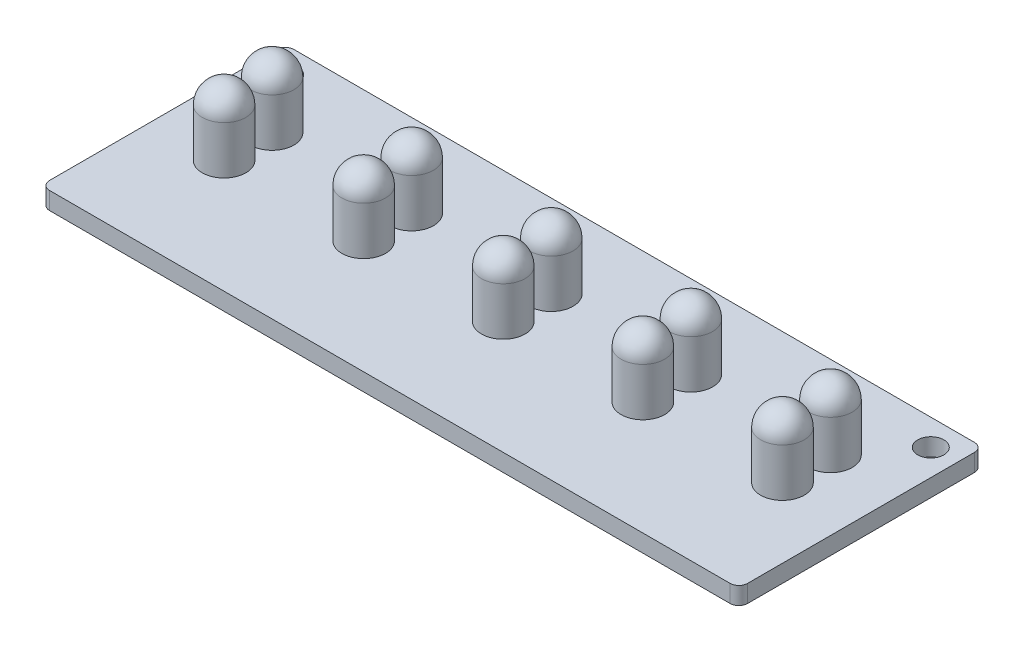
ISO-10303-21;
HEADER;
FILE_DESCRIPTION(('STEP AP214'),'2;1');
FILE_NAME('part.step','',(''),(''),'','','');
FILE_SCHEMA(('AUTOMOTIVE_DESIGN { 1 0 10303 214 1 1 1 1 }'));
ENDSEC;
DATA;
#1=APPLICATION_CONTEXT('core data for automotive mechanical design processes');
#2=APPLICATION_PROTOCOL_DEFINITION('international standard','automotive_design',2000,#1);
#3=PRODUCT_CONTEXT('',#1,'mechanical');
#4=PRODUCT('Part','Part','',(#3));
#5=PRODUCT_RELATED_PRODUCT_CATEGORY('part','',(#4));
#6=PRODUCT_DEFINITION_FORMATION('','',#4);
#7=PRODUCT_DEFINITION_CONTEXT('part definition',#1,'design');
#8=PRODUCT_DEFINITION('design','',#6,#7);
#9=PRODUCT_DEFINITION_SHAPE('','',#8);
#10=(LENGTH_UNIT() NAMED_UNIT(*) SI_UNIT(.MILLI.,.METRE.));
#11=(NAMED_UNIT(*) PLANE_ANGLE_UNIT() SI_UNIT($,.RADIAN.));
#12=(NAMED_UNIT(*) SI_UNIT($,.STERADIAN.) SOLID_ANGLE_UNIT());
#13=UNCERTAINTY_MEASURE_WITH_UNIT(LENGTH_MEASURE(1.E-05),#10,'distance_accuracy_value','');
#14=(GEOMETRIC_REPRESENTATION_CONTEXT(3) GLOBAL_UNCERTAINTY_ASSIGNED_CONTEXT((#13)) GLOBAL_UNIT_ASSIGNED_CONTEXT((#10,
#11,#12)) REPRESENTATION_CONTEXT('',''));
#15=CARTESIAN_POINT('',(0.,0.,0.));
#16=DIRECTION('',(0.,0.,1.));
#17=DIRECTION('',(1.,0.,0.));
#18=AXIS2_PLACEMENT_3D('',#15,#16,#17);
#19=CARTESIAN_POINT('',(40.,2.,14.));
#20=DIRECTION('',(-1.,0.,0.));
#21=DIRECTION('',(0.,0.,1.));
#22=AXIS2_PLACEMENT_3D('',#19,#20,#21);
#23=PLANE('',#22);
#24=DIRECTION('',(0.,0.,-1.));
#25=VECTOR('',#24,1.);
#26=CARTESIAN_POINT('',(40.,0.,14.));
#27=LINE('',#26,#25);
#28=CARTESIAN_POINT('',(40.,0.,13.));
#29=VERTEX_POINT('',#28);
#30=CARTESIAN_POINT('',(40.,0.,-13.));
#31=VERTEX_POINT('',#30);
#32=EDGE_CURVE('E198',#29,#31,#27,.T.);
#33=ORIENTED_EDGE('',*,*,#32,.T.);
#34=DIRECTION('',(0.,-1.,0.));
#35=VECTOR('',#34,1.);
#36=CARTESIAN_POINT('',(40.,2.,-13.));
#37=LINE('',#36,#35);
#38=CARTESIAN_POINT('',(40.,2.,-13.));
#39=VERTEX_POINT('',#38);
#40=EDGE_CURVE('E261',#31,#39,#37,.F.);
#41=ORIENTED_EDGE('',*,*,#40,.T.);
#42=DIRECTION('',(0.,0.,-1.));
#43=VECTOR('',#42,1.);
#44=CARTESIAN_POINT('',(40.,2.,14.));
#45=LINE('',#44,#43);
#46=CARTESIAN_POINT('',(40.,2.,13.));
#47=VERTEX_POINT('',#46);
#48=EDGE_CURVE('E210',#47,#39,#45,.T.);
#49=ORIENTED_EDGE('',*,*,#48,.F.);
#50=DIRECTION('',(0.,-1.,0.));
#51=VECTOR('',#50,1.);
#52=CARTESIAN_POINT('',(40.,2.,13.));
#53=LINE('',#52,#51);
#54=EDGE_CURVE('E257',#47,#29,#53,.T.);
#55=ORIENTED_EDGE('',*,*,#54,.T.);
#56=EDGE_LOOP('',(#33,#41,#49,#55));
#57=FACE_BOUND('',#56,.T.);
#58=ADVANCED_FACE('F45',(#57),#23,.F.);
#59=CARTESIAN_POINT('',(-40.,2.,-14.));
#60=DIRECTION('',(0.,0.,1.));
#61=DIRECTION('',(1.,0.,0.));
#62=AXIS2_PLACEMENT_3D('',#59,#60,#61);
#63=PLANE('',#62);
#64=DIRECTION('',(-1.,0.,0.));
#65=VECTOR('',#64,1.);
#66=CARTESIAN_POINT('',(-40.,2.,-14.));
#67=LINE('',#66,#65);
#68=CARTESIAN_POINT('',(39.,2.,-14.));
#69=VERTEX_POINT('',#68);
#70=CARTESIAN_POINT('',(-39.,2.,-14.));
#71=VERTEX_POINT('',#70);
#72=EDGE_CURVE('E214',#69,#71,#67,.T.);
#73=ORIENTED_EDGE('',*,*,#72,.F.);
#74=DIRECTION('',(0.,-1.,0.));
#75=VECTOR('',#74,1.);
#76=CARTESIAN_POINT('',(39.,2.,-14.));
#77=LINE('',#76,#75);
#78=CARTESIAN_POINT('',(39.,0.,-14.));
#79=VERTEX_POINT('',#78);
#80=EDGE_CURVE('E241',#69,#79,#77,.T.);
#81=ORIENTED_EDGE('',*,*,#80,.T.);
#82=DIRECTION('',(-1.,0.,0.));
#83=VECTOR('',#82,1.);
#84=CARTESIAN_POINT('',(-40.,0.,-14.));
#85=LINE('',#84,#83);
#86=CARTESIAN_POINT('',(-39.,0.,-14.));
#87=VERTEX_POINT('',#86);
#88=EDGE_CURVE('E229',#79,#87,#85,.T.);
#89=ORIENTED_EDGE('',*,*,#88,.T.);
#90=DIRECTION('',(0.,-1.,0.));
#91=VECTOR('',#90,1.);
#92=CARTESIAN_POINT('',(-39.,2.,-14.));
#93=LINE('',#92,#91);
#94=EDGE_CURVE('E225',#87,#71,#93,.F.);
#95=ORIENTED_EDGE('',*,*,#94,.T.);
#96=EDGE_LOOP('',(#73,#81,#89,#95));
#97=FACE_BOUND('',#96,.T.);
#98=ADVANCED_FACE('F312',(#97),#63,.F.);
#99=CARTESIAN_POINT('',(-40.,2.,14.));
#100=DIRECTION('',(1.,0.,0.));
#101=DIRECTION('',(0.,0.,-1.));
#102=AXIS2_PLACEMENT_3D('',#99,#100,#101);
#103=PLANE('',#102);
#104=DIRECTION('',(0.,0.,1.));
#105=VECTOR('',#104,1.);
#106=CARTESIAN_POINT('',(-40.,2.,14.));
#107=LINE('',#106,#105);
#108=CARTESIAN_POINT('',(-40.,2.,-13.));
#109=VERTEX_POINT('',#108);
#110=CARTESIAN_POINT('',(-40.,2.,13.));
#111=VERTEX_POINT('',#110);
#112=EDGE_CURVE('E219',#109,#111,#107,.T.);
#113=ORIENTED_EDGE('',*,*,#112,.F.);
#114=DIRECTION('',(0.,-1.,0.));
#115=VECTOR('',#114,1.);
#116=CARTESIAN_POINT('',(-40.,2.,-13.));
#117=LINE('',#116,#115);
#118=CARTESIAN_POINT('',(-40.,0.,-13.));
#119=VERTEX_POINT('',#118);
#120=EDGE_CURVE('E278',#109,#119,#117,.T.);
#121=ORIENTED_EDGE('',*,*,#120,.T.);
#122=DIRECTION('',(0.,0.,1.));
#123=VECTOR('',#122,1.);
#124=CARTESIAN_POINT('',(-40.,0.,14.));
#125=LINE('',#124,#123);
#126=CARTESIAN_POINT('',(-40.,0.,13.));
#127=VERTEX_POINT('',#126);
#128=EDGE_CURVE('E233',#119,#127,#125,.T.);
#129=ORIENTED_EDGE('',*,*,#128,.T.);
#130=DIRECTION('',(0.,-1.,0.));
#131=VECTOR('',#130,1.);
#132=CARTESIAN_POINT('',(-40.,2.,13.));
#133=LINE('',#132,#131);
#134=EDGE_CURVE('E275',#127,#111,#133,.F.);
#135=ORIENTED_EDGE('',*,*,#134,.T.);
#136=EDGE_LOOP('',(#113,#121,#129,#135));
#137=FACE_BOUND('',#136,.T.);
#138=ADVANCED_FACE('F286',(#137),#103,.F.);
#139=CARTESIAN_POINT('',(-40.,2.,14.));
#140=DIRECTION('',(0.,0.,-1.));
#141=DIRECTION('',(-1.,0.,0.));
#142=AXIS2_PLACEMENT_3D('',#139,#140,#141);
#143=PLANE('',#142);
#144=DIRECTION('',(1.,0.,0.));
#145=VECTOR('',#144,1.);
#146=CARTESIAN_POINT('',(-40.,2.,14.));
#147=LINE('',#146,#145);
#148=CARTESIAN_POINT('',(-39.,2.,14.));
#149=VERTEX_POINT('',#148);
#150=CARTESIAN_POINT('',(39.,2.,14.));
#151=VERTEX_POINT('',#150);
#152=EDGE_CURVE('E222',#149,#151,#147,.T.);
#153=ORIENTED_EDGE('',*,*,#152,.F.);
#154=DIRECTION('',(0.,-1.,0.));
#155=VECTOR('',#154,1.);
#156=CARTESIAN_POINT('',(-39.,2.,14.));
#157=LINE('',#156,#155);
#158=CARTESIAN_POINT('',(-39.,0.,14.));
#159=VERTEX_POINT('',#158);
#160=EDGE_CURVE('E11',#149,#159,#157,.T.);
#161=ORIENTED_EDGE('',*,*,#160,.T.);
#162=DIRECTION('',(1.,0.,0.));
#163=VECTOR('',#162,1.);
#164=CARTESIAN_POINT('',(-40.,0.,14.));
#165=LINE('',#164,#163);
#166=CARTESIAN_POINT('',(39.,0.,14.));
#167=VERTEX_POINT('',#166);
#168=EDGE_CURVE('E215',#159,#167,#165,.T.);
#169=ORIENTED_EDGE('',*,*,#168,.T.);
#170=DIRECTION('',(0.,-1.,0.));
#171=VECTOR('',#170,1.);
#172=CARTESIAN_POINT('',(39.,2.,14.));
#173=LINE('',#172,#171);
#174=EDGE_CURVE('E54',#167,#151,#173,.F.);
#175=ORIENTED_EDGE('',*,*,#174,.T.);
#176=EDGE_LOOP('',(#153,#161,#169,#175));
#177=FACE_BOUND('',#176,.T.);
#178=ADVANCED_FACE('F297',(#177),#143,.F.);
#179=CARTESIAN_POINT('',(0.,2.,0.));
#180=DIRECTION('',(0.,-1.,0.));
#181=DIRECTION('',(0.,0.,-1.));
#182=AXIS2_PLACEMENT_3D('',#179,#180,#181);
#183=PLANE('',#182);
#184=CARTESIAN_POINT('',(32.,2.,-4.5));
#185=DIRECTION('',(0.,1.,0.));
#186=DIRECTION('',(0.,0.,1.));
#187=AXIS2_PLACEMENT_3D('',#184,#185,#186);
#188=CIRCLE('',#187,2.5);
#189=CARTESIAN_POINT('',(32.,2.,-2.));
#190=VERTEX_POINT('',#189);
#191=EDGE_CURVE('E447',#190,#190,#188,.T.);
#192=ORIENTED_EDGE('',*,*,#191,.F.);
#193=EDGE_LOOP('',(#192));
#194=FACE_BOUND('',#193,.T.);
#195=CARTESIAN_POINT('',(16.,2.,-4.5));
#196=DIRECTION('',(0.,1.,0.));
#197=DIRECTION('',(0.,0.,1.));
#198=AXIS2_PLACEMENT_3D('',#195,#196,#197);
#199=CIRCLE('',#198,2.5);
#200=CARTESIAN_POINT('',(16.,2.,-2.));
#201=VERTEX_POINT('',#200);
#202=EDGE_CURVE('E457',#201,#201,#199,.T.);
#203=ORIENTED_EDGE('',*,*,#202,.F.);
#204=EDGE_LOOP('',(#203));
#205=FACE_BOUND('',#204,.T.);
#206=CARTESIAN_POINT('',(-32.,2.,-4.5));
#207=DIRECTION('',(0.,1.,0.));
#208=DIRECTION('',(0.,0.,1.));
#209=AXIS2_PLACEMENT_3D('',#206,#207,#208);
#210=CIRCLE('',#209,2.5);
#211=CARTESIAN_POINT('',(-32.,2.,-2.));
#212=VERTEX_POINT('',#211);
#213=EDGE_CURVE('E465',#212,#212,#210,.T.);
#214=ORIENTED_EDGE('',*,*,#213,.F.);
#215=EDGE_LOOP('',(#214));
#216=FACE_BOUND('',#215,.T.);
#217=CARTESIAN_POINT('',(-16.,2.,-4.5));
#218=DIRECTION('',(0.,1.,0.));
#219=DIRECTION('',(0.,0.,1.));
#220=AXIS2_PLACEMENT_3D('',#217,#218,#219);
#221=CIRCLE('',#220,2.5);
#222=CARTESIAN_POINT('',(-16.,2.,-2.));
#223=VERTEX_POINT('',#222);
#224=EDGE_CURVE('E473',#223,#223,#221,.T.);
#225=ORIENTED_EDGE('',*,*,#224,.F.);
#226=EDGE_LOOP('',(#225));
#227=FACE_BOUND('',#226,.T.);
#228=CARTESIAN_POINT('',(32.,2.,0.999999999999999));
#229=DIRECTION('',(0.,1.,0.));
#230=DIRECTION('',(0.,0.,1.));
#231=AXIS2_PLACEMENT_3D('',#228,#229,#230);
#232=CIRCLE('',#231,2.5);
#233=CARTESIAN_POINT('',(32.,2.,3.5));
#234=VERTEX_POINT('',#233);
#235=EDGE_CURVE('E481',#234,#234,#232,.T.);
#236=ORIENTED_EDGE('',*,*,#235,.F.);
#237=EDGE_LOOP('',(#236));
#238=FACE_BOUND('',#237,.T.);
#239=CARTESIAN_POINT('',(16.,2.,0.999999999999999));
#240=DIRECTION('',(0.,1.,0.));
#241=DIRECTION('',(0.,0.,1.));
#242=AXIS2_PLACEMENT_3D('',#239,#240,#241);
#243=CIRCLE('',#242,2.5);
#244=CARTESIAN_POINT('',(16.,2.,3.5));
#245=VERTEX_POINT('',#244);
#246=EDGE_CURVE('E489',#245,#245,#243,.T.);
#247=ORIENTED_EDGE('',*,*,#246,.F.);
#248=EDGE_LOOP('',(#247));
#249=FACE_BOUND('',#248,.T.);
#250=CARTESIAN_POINT('',(-32.,2.,0.999999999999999));
#251=DIRECTION('',(0.,1.,0.));
#252=DIRECTION('',(0.,0.,1.));
#253=AXIS2_PLACEMENT_3D('',#250,#251,#252);
#254=CIRCLE('',#253,2.5);
#255=CARTESIAN_POINT('',(-32.,2.,3.5));
#256=VERTEX_POINT('',#255);
#257=EDGE_CURVE('E497',#256,#256,#254,.T.);
#258=ORIENTED_EDGE('',*,*,#257,.F.);
#259=EDGE_LOOP('',(#258));
#260=FACE_BOUND('',#259,.T.);
#261=CARTESIAN_POINT('',(-16.,2.,0.999999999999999));
#262=DIRECTION('',(0.,1.,0.));
#263=DIRECTION('',(0.,0.,1.));
#264=AXIS2_PLACEMENT_3D('',#261,#262,#263);
#265=CIRCLE('',#264,2.5);
#266=CARTESIAN_POINT('',(-16.,2.,3.5));
#267=VERTEX_POINT('',#266);
#268=EDGE_CURVE('E505',#267,#267,#265,.T.);
#269=ORIENTED_EDGE('',*,*,#268,.F.);
#270=EDGE_LOOP('',(#269));
#271=FACE_BOUND('',#270,.T.);
#272=CARTESIAN_POINT('',(0.,2.,-4.5));
#273=DIRECTION('',(0.,1.,0.));
#274=DIRECTION('',(0.,0.,1.));
#275=AXIS2_PLACEMENT_3D('',#272,#273,#274);
#276=CIRCLE('',#275,2.5);
#277=CARTESIAN_POINT('',(0.,2.,-2.));
#278=VERTEX_POINT('',#277);
#279=EDGE_CURVE('E513',#278,#278,#276,.T.);
#280=ORIENTED_EDGE('',*,*,#279,.F.);
#281=EDGE_LOOP('',(#280));
#282=FACE_BOUND('',#281,.T.);
#283=CARTESIAN_POINT('',(0.,2.,0.999999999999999));
#284=DIRECTION('',(0.,1.,0.));
#285=DIRECTION('',(0.,0.,1.));
#286=AXIS2_PLACEMENT_3D('',#283,#284,#285);
#287=CIRCLE('',#286,2.5);
#288=CARTESIAN_POINT('',(0.,2.,3.5));
#289=VERTEX_POINT('',#288);
#290=EDGE_CURVE('E171',#289,#289,#287,.T.);
#291=ORIENTED_EDGE('',*,*,#290,.F.);
#292=EDGE_LOOP('',(#291));
#293=FACE_BOUND('',#292,.T.);
#294=CARTESIAN_POINT('',(-37.,2.,-11.));
#295=DIRECTION('',(0.,1.,0.));
#296=DIRECTION('',(0.,0.,1.));
#297=AXIS2_PLACEMENT_3D('',#294,#295,#296);
#298=CIRCLE('',#297,1.5);
#299=CARTESIAN_POINT('',(-37.,2.,-9.49999999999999));
#300=VERTEX_POINT('',#299);
#301=EDGE_CURVE('E199',#300,#300,#298,.T.);
#302=ORIENTED_EDGE('',*,*,#301,.F.);
#303=EDGE_LOOP('',(#302));
#304=FACE_BOUND('',#303,.T.);
#305=CARTESIAN_POINT('',(37.,2.,-11.));
#306=DIRECTION('',(0.,1.,0.));
#307=DIRECTION('',(0.,0.,-1.));
#308=AXIS2_PLACEMENT_3D('',#305,#306,#307);
#309=CIRCLE('',#308,1.5);
#310=CARTESIAN_POINT('',(37.,2.,-12.5));
#311=VERTEX_POINT('',#310);
#312=EDGE_CURVE('E203',#311,#311,#309,.T.);
#313=ORIENTED_EDGE('',*,*,#312,.F.);
#314=EDGE_LOOP('',(#313));
#315=FACE_BOUND('',#314,.T.);
#316=ORIENTED_EDGE('',*,*,#48,.T.);
#317=CARTESIAN_POINT('',(39.,2.,-13.));
#318=DIRECTION('',(0.,-1.,0.));
#319=DIRECTION('',(0.,0.,-1.));
#320=AXIS2_PLACEMENT_3D('',#317,#318,#319);
#321=CIRCLE('',#320,1.);
#322=EDGE_CURVE('E272',#39,#69,#321,.F.);
#323=ORIENTED_EDGE('',*,*,#322,.T.);
#324=ORIENTED_EDGE('',*,*,#72,.T.);
#325=CARTESIAN_POINT('',(-39.,2.,-13.));
#326=DIRECTION('',(0.,-1.,0.));
#327=DIRECTION('',(0.,0.,-1.));
#328=AXIS2_PLACEMENT_3D('',#325,#326,#327);
#329=CIRCLE('',#328,1.);
#330=EDGE_CURVE('E269',#71,#109,#329,.F.);
#331=ORIENTED_EDGE('',*,*,#330,.T.);
#332=ORIENTED_EDGE('',*,*,#112,.T.);
#333=CARTESIAN_POINT('',(-39.,2.,13.));
#334=DIRECTION('',(0.,-1.,0.));
#335=DIRECTION('',(0.,0.,-1.));
#336=AXIS2_PLACEMENT_3D('',#333,#334,#335);
#337=CIRCLE('',#336,1.);
#338=EDGE_CURVE('E67',#111,#149,#337,.F.);
#339=ORIENTED_EDGE('',*,*,#338,.T.);
#340=ORIENTED_EDGE('',*,*,#152,.T.);
#341=CARTESIAN_POINT('',(39.,2.,13.));
#342=DIRECTION('',(0.,-1.,0.));
#343=DIRECTION('',(0.,0.,-1.));
#344=AXIS2_PLACEMENT_3D('',#341,#342,#343);
#345=CIRCLE('',#344,1.);
#346=EDGE_CURVE('E264',#151,#47,#345,.F.);
#347=ORIENTED_EDGE('',*,*,#346,.T.);
#348=EDGE_LOOP('',(#316,#323,#324,#331,#332,#339,#340,#347));
#349=FACE_BOUND('',#348,.T.);
#350=ADVANCED_FACE('F299',(#194,#205,#216,#227,#238,#249,#260,#271,#282,#293,#304,#315,#349),
#183,.F.);
#351=CARTESIAN_POINT('',(0.,0.,0.));
#352=DIRECTION('',(0.,-1.,0.));
#353=DIRECTION('',(0.,0.,-1.));
#354=AXIS2_PLACEMENT_3D('',#351,#352,#353);
#355=PLANE('',#354);
#356=DIRECTION('',(0.,0.,-1.));
#357=VECTOR('',#356,1.);
#358=CARTESIAN_POINT('',(5.,0.,-12.5));
#359=LINE('',#358,#357);
#360=CARTESIAN_POINT('',(5.,0.,-7.5));
#361=VERTEX_POINT('',#360);
#362=CARTESIAN_POINT('',(5.,0.,-12.5));
#363=VERTEX_POINT('',#362);
#364=EDGE_CURVE('E178',#361,#363,#359,.T.);
#365=ORIENTED_EDGE('',*,*,#364,.T.);
#366=DIRECTION('',(-1.,0.,0.));
#367=VECTOR('',#366,1.);
#368=CARTESIAN_POINT('',(-15.,0.,-12.5));
#369=LINE('',#368,#367);
#370=CARTESIAN_POINT('',(-15.,0.,-12.5));
#371=VERTEX_POINT('',#370);
#372=EDGE_CURVE('E142',#363,#371,#369,.T.);
#373=ORIENTED_EDGE('',*,*,#372,.T.);
#374=DIRECTION('',(0.,0.,1.));
#375=VECTOR('',#374,1.);
#376=CARTESIAN_POINT('',(-15.,0.,-12.5));
#377=LINE('',#376,#375);
#378=CARTESIAN_POINT('',(-15.,0.,-7.5));
#379=VERTEX_POINT('',#378);
#380=EDGE_CURVE('E168',#371,#379,#377,.T.);
#381=ORIENTED_EDGE('',*,*,#380,.T.);
#382=DIRECTION('',(1.,0.,0.));
#383=VECTOR('',#382,1.);
#384=CARTESIAN_POINT('',(-15.,0.,-7.5));
#385=LINE('',#384,#383);
#386=EDGE_CURVE('E165',#379,#361,#385,.T.);
#387=ORIENTED_EDGE('',*,*,#386,.T.);
#388=EDGE_LOOP('',(#365,#373,#381,#387));
#389=FACE_BOUND('',#388,.T.);
#390=CARTESIAN_POINT('',(-37.,0.,-11.));
#391=DIRECTION('',(0.,1.,0.));
#392=DIRECTION('',(0.,0.,1.));
#393=AXIS2_PLACEMENT_3D('',#390,#391,#392);
#394=CIRCLE('',#393,1.5);
#395=CARTESIAN_POINT('',(-37.,0.,-9.49999999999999));
#396=VERTEX_POINT('',#395);
#397=EDGE_CURVE('E194',#396,#396,#394,.T.);
#398=ORIENTED_EDGE('',*,*,#397,.T.);
#399=EDGE_LOOP('',(#398));
#400=FACE_BOUND('',#399,.T.);
#401=CARTESIAN_POINT('',(37.,0.,-11.));
#402=DIRECTION('',(0.,1.,0.));
#403=DIRECTION('',(0.,0.,-1.));
#404=AXIS2_PLACEMENT_3D('',#401,#402,#403);
#405=CIRCLE('',#404,1.5);
#406=CARTESIAN_POINT('',(37.,0.,-12.5));
#407=VERTEX_POINT('',#406);
#408=EDGE_CURVE('E187',#407,#407,#405,.T.);
#409=ORIENTED_EDGE('',*,*,#408,.T.);
#410=EDGE_LOOP('',(#409));
#411=FACE_BOUND('',#410,.T.);
#412=ORIENTED_EDGE('',*,*,#88,.F.);
#413=CARTESIAN_POINT('',(39.,0.,-13.));
#414=DIRECTION('',(0.,-1.,0.));
#415=DIRECTION('',(0.,0.,-1.));
#416=AXIS2_PLACEMENT_3D('',#413,#414,#415);
#417=CIRCLE('',#416,1.);
#418=EDGE_CURVE('E254',#79,#31,#417,.T.);
#419=ORIENTED_EDGE('',*,*,#418,.T.);
#420=ORIENTED_EDGE('',*,*,#32,.F.);
#421=CARTESIAN_POINT('',(39.,0.,13.));
#422=DIRECTION('',(0.,-1.,0.));
#423=DIRECTION('',(0.,0.,-1.));
#424=AXIS2_PLACEMENT_3D('',#421,#422,#423);
#425=CIRCLE('',#424,1.);
#426=EDGE_CURVE('E245',#29,#167,#425,.T.);
#427=ORIENTED_EDGE('',*,*,#426,.T.);
#428=ORIENTED_EDGE('',*,*,#168,.F.);
#429=CARTESIAN_POINT('',(-39.,0.,13.));
#430=DIRECTION('',(0.,-1.,0.));
#431=DIRECTION('',(0.,0.,-1.));
#432=AXIS2_PLACEMENT_3D('',#429,#430,#431);
#433=CIRCLE('',#432,1.);
#434=EDGE_CURVE('E248',#159,#127,#433,.T.);
#435=ORIENTED_EDGE('',*,*,#434,.T.);
#436=ORIENTED_EDGE('',*,*,#128,.F.);
#437=CARTESIAN_POINT('',(-39.,0.,-13.));
#438=DIRECTION('',(0.,-1.,0.));
#439=DIRECTION('',(0.,0.,-1.));
#440=AXIS2_PLACEMENT_3D('',#437,#438,#439);
#441=CIRCLE('',#440,1.);
#442=EDGE_CURVE('E251',#119,#87,#441,.T.);
#443=ORIENTED_EDGE('',*,*,#442,.T.);
#444=EDGE_LOOP('',(#412,#419,#420,#427,#428,#435,#436,#443));
#445=FACE_BOUND('',#444,.T.);
#446=ADVANCED_FACE('F292',(#389,#400,#411,#445),#355,.T.);
#447=CARTESIAN_POINT('',(37.,0.,-11.));
#448=DIRECTION('',(0.,1.,0.));
#449=DIRECTION('',(0.,0.,1.));
#450=AXIS2_PLACEMENT_3D('',#447,#448,#449);
#451=CYLINDRICAL_SURFACE('',#450,1.5);
#452=ORIENTED_EDGE('',*,*,#408,.F.);
#453=EDGE_LOOP('',(#452));
#454=FACE_BOUND('',#453,.T.);
#455=ORIENTED_EDGE('',*,*,#312,.T.);
#456=EDGE_LOOP('',(#455));
#457=FACE_BOUND('',#456,.T.);
#458=ADVANCED_FACE('F336',(#454,#457),#451,.F.);
#459=CARTESIAN_POINT('',(-37.,0.,-11.));
#460=DIRECTION('',(0.,1.,0.));
#461=DIRECTION('',(0.,0.,1.));
#462=AXIS2_PLACEMENT_3D('',#459,#460,#461);
#463=CYLINDRICAL_SURFACE('',#462,1.5);
#464=ORIENTED_EDGE('',*,*,#397,.F.);
#465=EDGE_LOOP('',(#464));
#466=FACE_BOUND('',#465,.T.);
#467=ORIENTED_EDGE('',*,*,#301,.T.);
#468=EDGE_LOOP('',(#467));
#469=FACE_BOUND('',#468,.T.);
#470=ADVANCED_FACE('F343',(#466,#469),#463,.F.);
#471=CARTESIAN_POINT('',(5.,-6.,-12.5));
#472=DIRECTION('',(1.,0.,0.));
#473=DIRECTION('',(0.,0.,-1.));
#474=AXIS2_PLACEMENT_3D('',#471,#472,#473);
#475=PLANE('',#474);
#476=ORIENTED_EDGE('',*,*,#364,.F.);
#477=DIRECTION('',(0.,1.,0.));
#478=VECTOR('',#477,1.);
#479=CARTESIAN_POINT('',(5.,-6.,-7.5));
#480=LINE('',#479,#478);
#481=CARTESIAN_POINT('',(5.,-6.,-7.5));
#482=VERTEX_POINT('',#481);
#483=EDGE_CURVE('E163',#482,#361,#480,.T.);
#484=ORIENTED_EDGE('',*,*,#483,.F.);
#485=DIRECTION('',(0.,0.,-1.));
#486=VECTOR('',#485,1.);
#487=CARTESIAN_POINT('',(5.,-6.,-12.5));
#488=LINE('',#487,#486);
#489=CARTESIAN_POINT('',(5.,-6.,-12.5));
#490=VERTEX_POINT('',#489);
#491=EDGE_CURVE('E155',#482,#490,#488,.T.);
#492=ORIENTED_EDGE('',*,*,#491,.T.);
#493=DIRECTION('',(0.,1.,0.));
#494=VECTOR('',#493,1.);
#495=CARTESIAN_POINT('',(5.,-6.,-12.5));
#496=LINE('',#495,#494);
#497=EDGE_CURVE('E137',#490,#363,#496,.T.);
#498=ORIENTED_EDGE('',*,*,#497,.T.);
#499=EDGE_LOOP('',(#476,#484,#492,#498));
#500=FACE_BOUND('',#499,.T.);
#501=ADVANCED_FACE('F161',(#500),#475,.T.);
#502=CARTESIAN_POINT('',(-15.,-6.,-7.5));
#503=DIRECTION('',(0.,0.,1.));
#504=DIRECTION('',(1.,0.,0.));
#505=AXIS2_PLACEMENT_3D('',#502,#503,#504);
#506=PLANE('',#505);
#507=ORIENTED_EDGE('',*,*,#386,.F.);
#508=DIRECTION('',(0.,1.,0.));
#509=VECTOR('',#508,1.);
#510=CARTESIAN_POINT('',(-15.,-6.,-7.5));
#511=LINE('',#510,#509);
#512=CARTESIAN_POINT('',(-15.,-6.,-7.5));
#513=VERTEX_POINT('',#512);
#514=EDGE_CURVE('E188',#513,#379,#511,.T.);
#515=ORIENTED_EDGE('',*,*,#514,.F.);
#516=DIRECTION('',(1.,0.,0.));
#517=VECTOR('',#516,1.);
#518=CARTESIAN_POINT('',(-15.,-6.,-7.5));
#519=LINE('',#518,#517);
#520=EDGE_CURVE('E148',#513,#482,#519,.T.);
#521=ORIENTED_EDGE('',*,*,#520,.T.);
#522=ORIENTED_EDGE('',*,*,#483,.T.);
#523=EDGE_LOOP('',(#507,#515,#521,#522));
#524=FACE_BOUND('',#523,.T.);
#525=ADVANCED_FACE('F350',(#524),#506,.T.);
#526=CARTESIAN_POINT('',(-15.,-6.,-12.5));
#527=DIRECTION('',(-1.,0.,0.));
#528=DIRECTION('',(0.,0.,1.));
#529=AXIS2_PLACEMENT_3D('',#526,#527,#528);
#530=PLANE('',#529);
#531=ORIENTED_EDGE('',*,*,#380,.F.);
#532=DIRECTION('',(0.,1.,0.));
#533=VECTOR('',#532,1.);
#534=CARTESIAN_POINT('',(-15.,-6.,-12.5));
#535=LINE('',#534,#533);
#536=CARTESIAN_POINT('',(-15.,-6.,-12.5));
#537=VERTEX_POINT('',#536);
#538=EDGE_CURVE('E147',#537,#371,#535,.T.);
#539=ORIENTED_EDGE('',*,*,#538,.F.);
#540=DIRECTION('',(0.,0.,1.));
#541=VECTOR('',#540,1.);
#542=CARTESIAN_POINT('',(-15.,-6.,-12.5));
#543=LINE('',#542,#541);
#544=EDGE_CURVE('E158',#537,#513,#543,.T.);
#545=ORIENTED_EDGE('',*,*,#544,.T.);
#546=ORIENTED_EDGE('',*,*,#514,.T.);
#547=EDGE_LOOP('',(#531,#539,#545,#546));
#548=FACE_BOUND('',#547,.T.);
#549=ADVANCED_FACE('F353',(#548),#530,.T.);
#550=CARTESIAN_POINT('',(-15.,-6.,-12.5));
#551=DIRECTION('',(0.,0.,-1.));
#552=DIRECTION('',(-1.,0.,0.));
#553=AXIS2_PLACEMENT_3D('',#550,#551,#552);
#554=PLANE('',#553);
#555=ORIENTED_EDGE('',*,*,#372,.F.);
#556=ORIENTED_EDGE('',*,*,#497,.F.);
#557=DIRECTION('',(-1.,0.,0.));
#558=VECTOR('',#557,1.);
#559=CARTESIAN_POINT('',(-15.,-6.,-12.5));
#560=LINE('',#559,#558);
#561=EDGE_CURVE('E141',#490,#537,#560,.T.);
#562=ORIENTED_EDGE('',*,*,#561,.T.);
#563=ORIENTED_EDGE('',*,*,#538,.T.);
#564=EDGE_LOOP('',(#555,#556,#562,#563));
#565=FACE_BOUND('',#564,.T.);
#566=ADVANCED_FACE('F139',(#565),#554,.T.);
#567=CARTESIAN_POINT('',(0.,-6.,0.));
#568=DIRECTION('',(0.,1.,0.));
#569=DIRECTION('',(0.,0.,1.));
#570=AXIS2_PLACEMENT_3D('',#567,#568,#569);
#571=PLANE('',#570);
#572=ORIENTED_EDGE('',*,*,#491,.F.);
#573=ORIENTED_EDGE('',*,*,#520,.F.);
#574=ORIENTED_EDGE('',*,*,#544,.F.);
#575=ORIENTED_EDGE('',*,*,#561,.F.);
#576=EDGE_LOOP('',(#572,#573,#574,#575));
#577=FACE_BOUND('',#576,.T.);
#578=ADVANCED_FACE('F153',(#577),#571,.F.);
#579=CARTESIAN_POINT('',(0.,11.8614030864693,1.));
#580=DIRECTION('',(0.,1.,0.));
#581=DIRECTION('',(0.,0.,1.));
#582=AXIS2_PLACEMENT_3D('',#579,#580,#581);
#583=CYLINDRICAL_SURFACE('',#582,2.5);
#584=ORIENTED_EDGE('',*,*,#290,.T.);
#585=EDGE_LOOP('',(#584));
#586=FACE_BOUND('',#585,.T.);
#587=CARTESIAN_POINT('',(0.,7.5,0.999999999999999));
#588=DIRECTION('',(0.,1.,0.));
#589=DIRECTION('',(0.,0.,1.));
#590=AXIS2_PLACEMENT_3D('',#587,#588,#589);
#591=CIRCLE('',#590,2.5);
#592=CARTESIAN_POINT('',(0.,7.5,3.5));
#593=VERTEX_POINT('',#592);
#594=EDGE_CURVE('E516',#593,#593,#591,.T.);
#595=ORIENTED_EDGE('',*,*,#594,.F.);
#596=EDGE_LOOP('',(#595));
#597=FACE_BOUND('',#596,.T.);
#598=ADVANCED_FACE('F362',(#586,#597),#583,.T.);
#599=CARTESIAN_POINT('',(0.,7.5,0.999999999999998));
#600=DIRECTION('',(0.,1.,0.));
#601=DIRECTION('',(0.,0.,1.));
#602=AXIS2_PLACEMENT_3D('',#599,#600,#601);
#603=SPHERICAL_SURFACE('',#602,2.5);
#604=ORIENTED_EDGE('',*,*,#594,.T.);
#605=EDGE_LOOP('',(#604));
#606=FACE_BOUND('',#605,.T.);
#607=ADVANCED_FACE('F365',(#606),#603,.T.);
#608=CARTESIAN_POINT('',(0.,11.8614030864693,-4.5));
#609=DIRECTION('',(0.,1.,0.));
#610=DIRECTION('',(0.,0.,1.));
#611=AXIS2_PLACEMENT_3D('',#608,#609,#610);
#612=CYLINDRICAL_SURFACE('',#611,2.5);
#613=ORIENTED_EDGE('',*,*,#279,.T.);
#614=EDGE_LOOP('',(#613));
#615=FACE_BOUND('',#614,.T.);
#616=CARTESIAN_POINT('',(0.,7.5,-4.5));
#617=DIRECTION('',(0.,1.,0.));
#618=DIRECTION('',(0.,0.,1.));
#619=AXIS2_PLACEMENT_3D('',#616,#617,#618);
#620=CIRCLE('',#619,2.5);
#621=CARTESIAN_POINT('',(0.,7.5,-2.));
#622=VERTEX_POINT('',#621);
#623=EDGE_CURVE('E509',#622,#622,#620,.T.);
#624=ORIENTED_EDGE('',*,*,#623,.F.);
#625=EDGE_LOOP('',(#624));
#626=FACE_BOUND('',#625,.T.);
#627=ADVANCED_FACE('F369',(#615,#626),#612,.T.);
#628=CARTESIAN_POINT('',(0.,7.5,-4.5));
#629=DIRECTION('',(0.,1.,0.));
#630=DIRECTION('',(0.,0.,1.));
#631=AXIS2_PLACEMENT_3D('',#628,#629,#630);
#632=SPHERICAL_SURFACE('',#631,2.5);
#633=ORIENTED_EDGE('',*,*,#623,.T.);
#634=EDGE_LOOP('',(#633));
#635=FACE_BOUND('',#634,.T.);
#636=ADVANCED_FACE('F373',(#635),#632,.T.);
#637=CARTESIAN_POINT('',(-16.,11.8614030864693,1.));
#638=DIRECTION('',(0.,1.,0.));
#639=DIRECTION('',(0.,0.,1.));
#640=AXIS2_PLACEMENT_3D('',#637,#638,#639);
#641=CYLINDRICAL_SURFACE('',#640,2.5);
#642=ORIENTED_EDGE('',*,*,#268,.T.);
#643=EDGE_LOOP('',(#642));
#644=FACE_BOUND('',#643,.T.);
#645=CARTESIAN_POINT('',(-16.,7.5,0.999999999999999));
#646=DIRECTION('',(0.,1.,0.));
#647=DIRECTION('',(0.,0.,1.));
#648=AXIS2_PLACEMENT_3D('',#645,#646,#647);
#649=CIRCLE('',#648,2.5);
#650=CARTESIAN_POINT('',(-16.,7.5,3.5));
#651=VERTEX_POINT('',#650);
#652=EDGE_CURVE('E501',#651,#651,#649,.T.);
#653=ORIENTED_EDGE('',*,*,#652,.F.);
#654=EDGE_LOOP('',(#653));
#655=FACE_BOUND('',#654,.T.);
#656=ADVANCED_FACE('F377',(#644,#655),#641,.T.);
#657=CARTESIAN_POINT('',(-16.,7.5,0.999999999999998));
#658=DIRECTION('',(0.,1.,0.));
#659=DIRECTION('',(0.,0.,1.));
#660=AXIS2_PLACEMENT_3D('',#657,#658,#659);
#661=SPHERICAL_SURFACE('',#660,2.5);
#662=ORIENTED_EDGE('',*,*,#652,.T.);
#663=EDGE_LOOP('',(#662));
#664=FACE_BOUND('',#663,.T.);
#665=ADVANCED_FACE('F381',(#664),#661,.T.);
#666=CARTESIAN_POINT('',(-32.,11.8614030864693,1.));
#667=DIRECTION('',(0.,1.,0.));
#668=DIRECTION('',(0.,0.,1.));
#669=AXIS2_PLACEMENT_3D('',#666,#667,#668);
#670=CYLINDRICAL_SURFACE('',#669,2.5);
#671=ORIENTED_EDGE('',*,*,#257,.T.);
#672=EDGE_LOOP('',(#671));
#673=FACE_BOUND('',#672,.T.);
#674=CARTESIAN_POINT('',(-32.,7.5,0.999999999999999));
#675=DIRECTION('',(0.,1.,0.));
#676=DIRECTION('',(0.,0.,1.));
#677=AXIS2_PLACEMENT_3D('',#674,#675,#676);
#678=CIRCLE('',#677,2.5);
#679=CARTESIAN_POINT('',(-32.,7.5,3.5));
#680=VERTEX_POINT('',#679);
#681=EDGE_CURVE('E493',#680,#680,#678,.T.);
#682=ORIENTED_EDGE('',*,*,#681,.F.);
#683=EDGE_LOOP('',(#682));
#684=FACE_BOUND('',#683,.T.);
#685=ADVANCED_FACE('F385',(#673,#684),#670,.T.);
#686=CARTESIAN_POINT('',(-32.,7.5,0.999999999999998));
#687=DIRECTION('',(0.,1.,0.));
#688=DIRECTION('',(0.,0.,1.));
#689=AXIS2_PLACEMENT_3D('',#686,#687,#688);
#690=SPHERICAL_SURFACE('',#689,2.5);
#691=ORIENTED_EDGE('',*,*,#681,.T.);
#692=EDGE_LOOP('',(#691));
#693=FACE_BOUND('',#692,.T.);
#694=ADVANCED_FACE('F389',(#693),#690,.T.);
#695=CARTESIAN_POINT('',(16.,11.8614030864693,1.));
#696=DIRECTION('',(0.,1.,0.));
#697=DIRECTION('',(0.,0.,1.));
#698=AXIS2_PLACEMENT_3D('',#695,#696,#697);
#699=CYLINDRICAL_SURFACE('',#698,2.5);
#700=ORIENTED_EDGE('',*,*,#246,.T.);
#701=EDGE_LOOP('',(#700));
#702=FACE_BOUND('',#701,.T.);
#703=CARTESIAN_POINT('',(16.,7.5,0.999999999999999));
#704=DIRECTION('',(0.,1.,0.));
#705=DIRECTION('',(0.,0.,1.));
#706=AXIS2_PLACEMENT_3D('',#703,#704,#705);
#707=CIRCLE('',#706,2.5);
#708=CARTESIAN_POINT('',(16.,7.5,3.5));
#709=VERTEX_POINT('',#708);
#710=EDGE_CURVE('E485',#709,#709,#707,.T.);
#711=ORIENTED_EDGE('',*,*,#710,.F.);
#712=EDGE_LOOP('',(#711));
#713=FACE_BOUND('',#712,.T.);
#714=ADVANCED_FACE('F393',(#702,#713),#699,.T.);
#715=CARTESIAN_POINT('',(16.,7.5,0.999999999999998));
#716=DIRECTION('',(0.,1.,0.));
#717=DIRECTION('',(0.,0.,1.));
#718=AXIS2_PLACEMENT_3D('',#715,#716,#717);
#719=SPHERICAL_SURFACE('',#718,2.5);
#720=ORIENTED_EDGE('',*,*,#710,.T.);
#721=EDGE_LOOP('',(#720));
#722=FACE_BOUND('',#721,.T.);
#723=ADVANCED_FACE('F397',(#722),#719,.T.);
#724=CARTESIAN_POINT('',(32.,11.8614030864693,1.));
#725=DIRECTION('',(0.,1.,0.));
#726=DIRECTION('',(0.,0.,1.));
#727=AXIS2_PLACEMENT_3D('',#724,#725,#726);
#728=CYLINDRICAL_SURFACE('',#727,2.5);
#729=ORIENTED_EDGE('',*,*,#235,.T.);
#730=EDGE_LOOP('',(#729));
#731=FACE_BOUND('',#730,.T.);
#732=CARTESIAN_POINT('',(32.,7.5,0.999999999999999));
#733=DIRECTION('',(0.,1.,0.));
#734=DIRECTION('',(0.,0.,1.));
#735=AXIS2_PLACEMENT_3D('',#732,#733,#734);
#736=CIRCLE('',#735,2.5);
#737=CARTESIAN_POINT('',(32.,7.5,3.5));
#738=VERTEX_POINT('',#737);
#739=EDGE_CURVE('E477',#738,#738,#736,.T.);
#740=ORIENTED_EDGE('',*,*,#739,.F.);
#741=EDGE_LOOP('',(#740));
#742=FACE_BOUND('',#741,.T.);
#743=ADVANCED_FACE('F401',(#731,#742),#728,.T.);
#744=CARTESIAN_POINT('',(32.,7.5,0.999999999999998));
#745=DIRECTION('',(0.,1.,0.));
#746=DIRECTION('',(0.,0.,1.));
#747=AXIS2_PLACEMENT_3D('',#744,#745,#746);
#748=SPHERICAL_SURFACE('',#747,2.5);
#749=ORIENTED_EDGE('',*,*,#739,.T.);
#750=EDGE_LOOP('',(#749));
#751=FACE_BOUND('',#750,.T.);
#752=ADVANCED_FACE('F405',(#751),#748,.T.);
#753=CARTESIAN_POINT('',(-16.,11.8614030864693,-4.5));
#754=DIRECTION('',(0.,1.,0.));
#755=DIRECTION('',(0.,0.,1.));
#756=AXIS2_PLACEMENT_3D('',#753,#754,#755);
#757=CYLINDRICAL_SURFACE('',#756,2.5);
#758=ORIENTED_EDGE('',*,*,#224,.T.);
#759=EDGE_LOOP('',(#758));
#760=FACE_BOUND('',#759,.T.);
#761=CARTESIAN_POINT('',(-16.,7.5,-4.5));
#762=DIRECTION('',(0.,1.,0.));
#763=DIRECTION('',(0.,0.,1.));
#764=AXIS2_PLACEMENT_3D('',#761,#762,#763);
#765=CIRCLE('',#764,2.5);
#766=CARTESIAN_POINT('',(-16.,7.5,-2.));
#767=VERTEX_POINT('',#766);
#768=EDGE_CURVE('E469',#767,#767,#765,.T.);
#769=ORIENTED_EDGE('',*,*,#768,.F.);
#770=EDGE_LOOP('',(#769));
#771=FACE_BOUND('',#770,.T.);
#772=ADVANCED_FACE('F409',(#760,#771),#757,.T.);
#773=CARTESIAN_POINT('',(-16.,7.5,-4.5));
#774=DIRECTION('',(0.,1.,0.));
#775=DIRECTION('',(0.,0.,1.));
#776=AXIS2_PLACEMENT_3D('',#773,#774,#775);
#777=SPHERICAL_SURFACE('',#776,2.5);
#778=ORIENTED_EDGE('',*,*,#768,.T.);
#779=EDGE_LOOP('',(#778));
#780=FACE_BOUND('',#779,.T.);
#781=ADVANCED_FACE('F413',(#780),#777,.T.);
#782=CARTESIAN_POINT('',(-32.,11.8614030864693,-4.5));
#783=DIRECTION('',(0.,1.,0.));
#784=DIRECTION('',(0.,0.,1.));
#785=AXIS2_PLACEMENT_3D('',#782,#783,#784);
#786=CYLINDRICAL_SURFACE('',#785,2.5);
#787=ORIENTED_EDGE('',*,*,#213,.T.);
#788=EDGE_LOOP('',(#787));
#789=FACE_BOUND('',#788,.T.);
#790=CARTESIAN_POINT('',(-32.,7.5,-4.5));
#791=DIRECTION('',(0.,1.,0.));
#792=DIRECTION('',(0.,0.,1.));
#793=AXIS2_PLACEMENT_3D('',#790,#791,#792);
#794=CIRCLE('',#793,2.5);
#795=CARTESIAN_POINT('',(-32.,7.5,-2.));
#796=VERTEX_POINT('',#795);
#797=EDGE_CURVE('E461',#796,#796,#794,.T.);
#798=ORIENTED_EDGE('',*,*,#797,.F.);
#799=EDGE_LOOP('',(#798));
#800=FACE_BOUND('',#799,.T.);
#801=ADVANCED_FACE('F417',(#789,#800),#786,.T.);
#802=CARTESIAN_POINT('',(-32.,7.5,-4.5));
#803=DIRECTION('',(0.,1.,0.));
#804=DIRECTION('',(0.,0.,1.));
#805=AXIS2_PLACEMENT_3D('',#802,#803,#804);
#806=SPHERICAL_SURFACE('',#805,2.5);
#807=ORIENTED_EDGE('',*,*,#797,.T.);
#808=EDGE_LOOP('',(#807));
#809=FACE_BOUND('',#808,.T.);
#810=ADVANCED_FACE('F421',(#809),#806,.T.);
#811=CARTESIAN_POINT('',(16.,11.8614030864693,-4.5));
#812=DIRECTION('',(0.,1.,0.));
#813=DIRECTION('',(0.,0.,1.));
#814=AXIS2_PLACEMENT_3D('',#811,#812,#813);
#815=CYLINDRICAL_SURFACE('',#814,2.5);
#816=ORIENTED_EDGE('',*,*,#202,.T.);
#817=EDGE_LOOP('',(#816));
#818=FACE_BOUND('',#817,.T.);
#819=CARTESIAN_POINT('',(16.,7.5,-4.5));
#820=DIRECTION('',(0.,1.,0.));
#821=DIRECTION('',(0.,0.,1.));
#822=AXIS2_PLACEMENT_3D('',#819,#820,#821);
#823=CIRCLE('',#822,2.5);
#824=CARTESIAN_POINT('',(16.,7.5,-2.));
#825=VERTEX_POINT('',#824);
#826=EDGE_CURVE('E451',#825,#825,#823,.T.);
#827=ORIENTED_EDGE('',*,*,#826,.F.);
#828=EDGE_LOOP('',(#827));
#829=FACE_BOUND('',#828,.T.);
#830=ADVANCED_FACE('F425',(#818,#829),#815,.T.);
#831=CARTESIAN_POINT('',(16.,7.5,-4.5));
#832=DIRECTION('',(0.,1.,0.));
#833=DIRECTION('',(0.,0.,1.));
#834=AXIS2_PLACEMENT_3D('',#831,#832,#833);
#835=SPHERICAL_SURFACE('',#834,2.5);
#836=ORIENTED_EDGE('',*,*,#826,.T.);
#837=EDGE_LOOP('',(#836));
#838=FACE_BOUND('',#837,.T.);
#839=ADVANCED_FACE('F429',(#838),#835,.T.);
#840=CARTESIAN_POINT('',(32.,11.8614030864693,-4.5));
#841=DIRECTION('',(0.,1.,0.));
#842=DIRECTION('',(0.,0.,1.));
#843=AXIS2_PLACEMENT_3D('',#840,#841,#842);
#844=CYLINDRICAL_SURFACE('',#843,2.5);
#845=ORIENTED_EDGE('',*,*,#191,.T.);
#846=EDGE_LOOP('',(#845));
#847=FACE_BOUND('',#846,.T.);
#848=CARTESIAN_POINT('',(32.,7.5,-4.5));
#849=DIRECTION('',(0.,1.,0.));
#850=DIRECTION('',(0.,0.,1.));
#851=AXIS2_PLACEMENT_3D('',#848,#849,#850);
#852=CIRCLE('',#851,2.5);
#853=CARTESIAN_POINT('',(32.,7.5,-2.));
#854=VERTEX_POINT('',#853);
#855=EDGE_CURVE('E444',#854,#854,#852,.T.);
#856=ORIENTED_EDGE('',*,*,#855,.F.);
#857=EDGE_LOOP('',(#856));
#858=FACE_BOUND('',#857,.T.);
#859=ADVANCED_FACE('F433',(#847,#858),#844,.T.);
#860=CARTESIAN_POINT('',(32.,7.5,-4.5));
#861=DIRECTION('',(0.,1.,0.));
#862=DIRECTION('',(0.,0.,1.));
#863=AXIS2_PLACEMENT_3D('',#860,#861,#862);
#864=SPHERICAL_SURFACE('',#863,2.5);
#865=ORIENTED_EDGE('',*,*,#855,.T.);
#866=EDGE_LOOP('',(#865));
#867=FACE_BOUND('',#866,.T.);
#868=ADVANCED_FACE('F321',(#867),#864,.T.);
#869=CARTESIAN_POINT('',(39.,2.,-13.));
#870=DIRECTION('',(0.,-1.,0.));
#871=DIRECTION('',(0.,0.,-1.));
#872=AXIS2_PLACEMENT_3D('',#869,#870,#871);
#873=CYLINDRICAL_SURFACE('',#872,1.);
#874=ORIENTED_EDGE('',*,*,#322,.F.);
#875=ORIENTED_EDGE('',*,*,#40,.F.);
#876=ORIENTED_EDGE('',*,*,#418,.F.);
#877=ORIENTED_EDGE('',*,*,#80,.F.);
#878=EDGE_LOOP('',(#874,#875,#876,#877));
#879=FACE_BOUND('',#878,.T.);
#880=ADVANCED_FACE('F309',(#879),#873,.T.);
#881=CARTESIAN_POINT('',(-39.,2.,-13.));
#882=DIRECTION('',(0.,-1.,0.));
#883=DIRECTION('',(0.,0.,-1.));
#884=AXIS2_PLACEMENT_3D('',#881,#882,#883);
#885=CYLINDRICAL_SURFACE('',#884,1.);
#886=ORIENTED_EDGE('',*,*,#330,.F.);
#887=ORIENTED_EDGE('',*,*,#94,.F.);
#888=ORIENTED_EDGE('',*,*,#442,.F.);
#889=ORIENTED_EDGE('',*,*,#120,.F.);
#890=EDGE_LOOP('',(#886,#887,#888,#889));
#891=FACE_BOUND('',#890,.T.);
#892=ADVANCED_FACE('F314',(#891),#885,.T.);
#893=CARTESIAN_POINT('',(-39.,2.,13.));
#894=DIRECTION('',(0.,-1.,0.));
#895=DIRECTION('',(0.,0.,-1.));
#896=AXIS2_PLACEMENT_3D('',#893,#894,#895);
#897=CYLINDRICAL_SURFACE('',#896,1.);
#898=ORIENTED_EDGE('',*,*,#338,.F.);
#899=ORIENTED_EDGE('',*,*,#134,.F.);
#900=ORIENTED_EDGE('',*,*,#434,.F.);
#901=ORIENTED_EDGE('',*,*,#160,.F.);
#902=EDGE_LOOP('',(#898,#899,#900,#901));
#903=FACE_BOUND('',#902,.T.);
#904=ADVANCED_FACE('F296',(#903),#897,.T.);
#905=CARTESIAN_POINT('',(39.,2.,13.));
#906=DIRECTION('',(0.,-1.,0.));
#907=DIRECTION('',(0.,0.,-1.));
#908=AXIS2_PLACEMENT_3D('',#905,#906,#907);
#909=CYLINDRICAL_SURFACE('',#908,1.);
#910=ORIENTED_EDGE('',*,*,#346,.F.);
#911=ORIENTED_EDGE('',*,*,#174,.F.);
#912=ORIENTED_EDGE('',*,*,#426,.F.);
#913=ORIENTED_EDGE('',*,*,#54,.F.);
#914=EDGE_LOOP('',(#910,#911,#912,#913));
#915=FACE_BOUND('',#914,.T.);
#916=ADVANCED_FACE('F47',(#915),#909,.T.);
#917=CLOSED_SHELL('',(#58,#98,#138,#178,#350,#446,#458,#470,#501,#525,#549,#566,#578,#598,#607,
#627,#636,#656,#665,#685,#694,#714,#723,#743,#752,#772,#781,#801,#810,#830,#839,#859,#868,#880,
#892,#904,#916));
#918=MANIFOLD_SOLID_BREP('B2',#917);
#919=ADVANCED_BREP_SHAPE_REPRESENTATION('',(#18,#918),#14);
#920=SHAPE_DEFINITION_REPRESENTATION(#9,#919);
ENDSEC;
END-ISO-10303-21;
